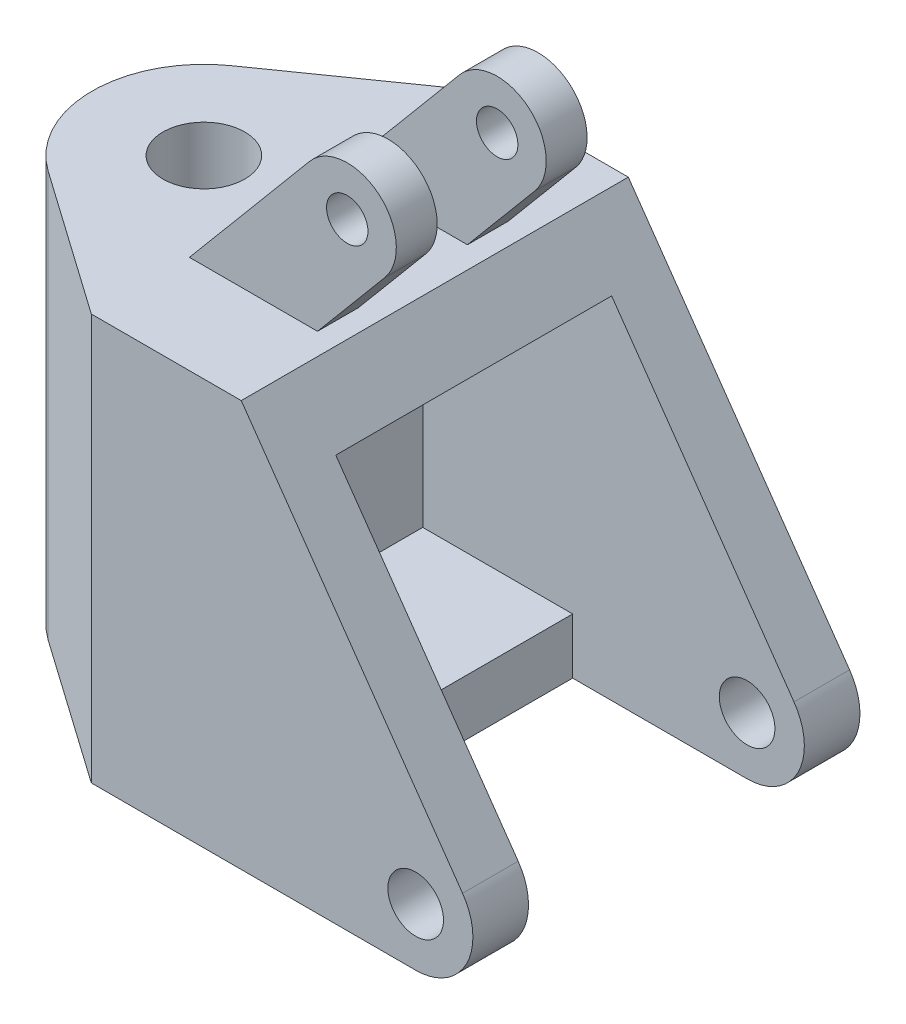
from build123d import *

# Parameters (mm, degrees)
SKETCH1_R           = 105
SKETCH1_R_2         = 51
BOSS_EXTRUDE1_DEPTH = 355
SKETCH2_W           = 506
SKETCH2_H           = 541
CUT_EXTRUDE1_DEPTH  = 1013.731455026
CUT_EXTRUDE2_REACH  = 1019.386
SKETCH3_W           = 425
SKETCH3_H           = 506
BOSS_EXTRUDE3_START = 100
SKETCH4_R           = 90
SKETCH4_R_2         = 38
BOSS_EXTRUDE3_DEPTH = 75
BOSS_EXTRUDE4_START = -745
SKETCH5_R           = 75
BOSS_EXTRUDE4_DEPTH = 745


with BuildPart() as part:
    # Sketch1 → Boss-Extrude1 (new, symmetric)
    # profile 1 of 2: a face of its own
    with BuildSketch(Plane.XY):
        with BuildLine():
            Line((-595, -105), (0, -105))
            ThreePointArc((0, -105), (-93.136137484, 48.48360439), (86.01096465, 60.225525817))
            Line((86.01096465, 60.225525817), (-319.951492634, 640))
            Line((-319.951492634, 640), (-595, 640))
            Line((-595, 640), (-595, -105))
        make_face()
    # profile 2 of 2: a face of its own
    with BuildSketch(Plane.XY):
        Circle(SKETCH1_R)
        Circle(SKETCH1_R_2, mode=Mode.SUBTRACT)
    extrude(amount=BOSS_EXTRUDE1_DEPTH, both=True)

    # Sketch2 → Cut-Extrude1 (cut, through all)
    with BuildSketch(Plane.ZY.offset(595)):
        with Locations((0, 267.5)):
            Rectangle(SKETCH2_W, SKETCH2_H)
    extrude(amount=-CUT_EXTRUDE1_DEPTH, mode=Mode.SUBTRACT)

    # Sketch3 → Cut-Extrude2 (cut, up to next)
    with BuildSketch(Plane.XZ.offset(105), mode=Mode.PRIVATE) as cut_extrude2_sk1:
        with Locations((-107.5, 0)):
            Rectangle(SKETCH3_W, SKETCH3_H)
    cut_extrude2_tool1 = extrude(cut_extrude2_sk1.sketch, amount=-CUT_EXTRUDE2_REACH, mode=Mode.PRIVATE) & part.part
    add(cut_extrude2_tool1.solids().sort_by_distance((-107.5, -105, 0))[0], mode=Mode.SUBTRACT)

    # Sketch4 → Boss-Extrude3 (add)
    # profile 1 of 2: a face of its own
    with BuildSketch(Plane.XY.offset(BOSS_EXTRUDE3_START)):
        with Locations((-305.497919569, 845)):
            Circle(SKETCH4_R)
        with Locations((-305.497919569, 845)):
            Circle(SKETCH4_R_2, mode=Mode.SUBTRACT)
    # profile 2 of 2: a face of its own
    with BuildSketch(Plane.XY.offset(BOSS_EXTRUDE3_START)):
        with BuildLine():
            Line((-374.441919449, 902.850884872), (-595, 640))
            Line((-595, 640), (-360.02668792, 640))
            Line((-360.02668792, 640), (-236.553919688, 787.149115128))
            ThreePointArc((-236.553919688, 787.149115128), (-363.348804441, 776.056000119), (-374.441919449, 902.850884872))
        make_face()
    boss_extrude3 = extrude(amount=BOSS_EXTRUDE3_DEPTH)

    # Mirror1: Boss-Extrude3 across plane
    add(boss_extrude3.mirror(Plane.XY))

    # Sketch5 → Boss-Extrude4 (add)
    with BuildSketch(Plane(origin=(0, 640, 0), x_dir=(1, 0, 0), z_dir=(0, 1, 0)).offset(BOSS_EXTRUDE4_START)):
        with BuildLine():
            Line((-595, 355), (-861.425678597, 167.707141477))
            ThreePointArc((-861.425678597, 167.707141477), (-948.530323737, 0), (-861.425678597, -167.707141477))
            Line((-861.425678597, -167.707141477), (-595, -355))
            Line((-595, -355), (-595, 355))
        make_face()
        with Locations(Location((-743.530323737, 0, 0), (0, 0, 270))):
            Circle(SKETCH5_R, mode=Mode.SUBTRACT)
    boss_extrude4 = extrude(amount=BOSS_EXTRUDE4_DEPTH)

    # Mirror2: Boss-Extrude4 across plane
    add(boss_extrude4.mirror(Plane.ZX.offset(267.5)))


solid = part.part
